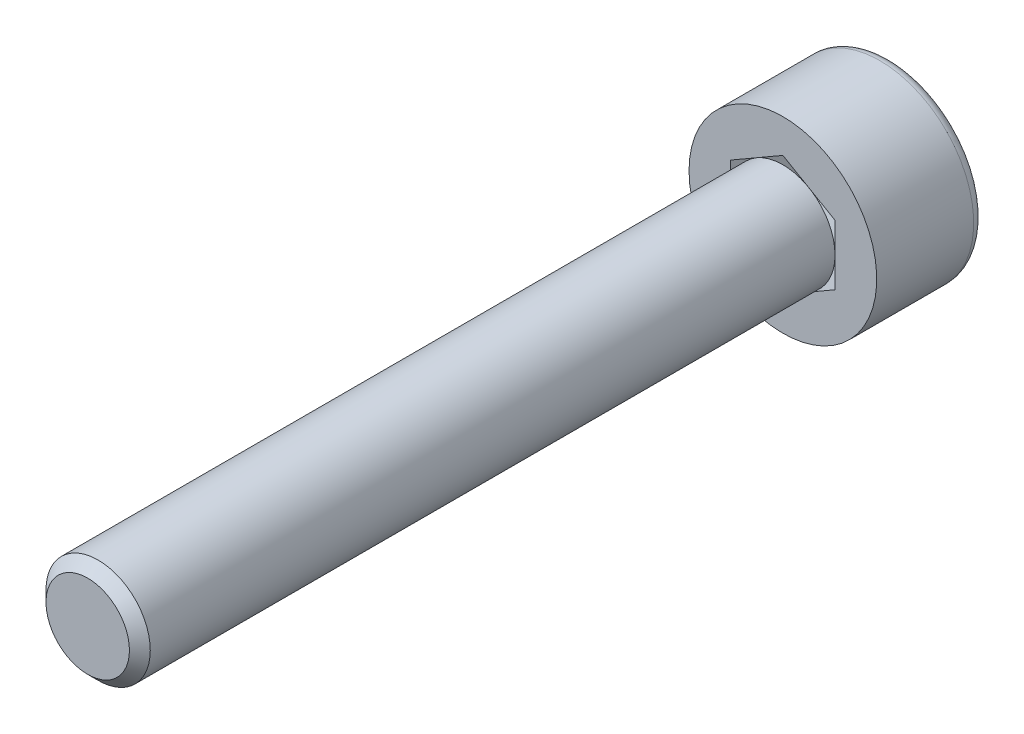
ISO-10303-21;
HEADER;
FILE_DESCRIPTION(('STEP AP214'),'2;1');
FILE_NAME('part.step','',(''),(''),'','','');
FILE_SCHEMA(('AUTOMOTIVE_DESIGN { 1 0 10303 214 1 1 1 1 }'));
ENDSEC;
DATA;
#1=APPLICATION_CONTEXT('core data for automotive mechanical design processes');
#2=APPLICATION_PROTOCOL_DEFINITION('international standard','automotive_design',2000,#1);
#3=PRODUCT_CONTEXT('',#1,'mechanical');
#4=PRODUCT('Part','Part','',(#3));
#5=PRODUCT_RELATED_PRODUCT_CATEGORY('part','',(#4));
#6=PRODUCT_DEFINITION_FORMATION('','',#4);
#7=PRODUCT_DEFINITION_CONTEXT('part definition',#1,'design');
#8=PRODUCT_DEFINITION('design','',#6,#7);
#9=PRODUCT_DEFINITION_SHAPE('','',#8);
#10=(LENGTH_UNIT() NAMED_UNIT(*) SI_UNIT(.MILLI.,.METRE.));
#11=(NAMED_UNIT(*) PLANE_ANGLE_UNIT() SI_UNIT($,.RADIAN.));
#12=(NAMED_UNIT(*) SI_UNIT($,.STERADIAN.) SOLID_ANGLE_UNIT());
#13=UNCERTAINTY_MEASURE_WITH_UNIT(LENGTH_MEASURE(1.E-05),#10,'distance_accuracy_value','');
#14=(GEOMETRIC_REPRESENTATION_CONTEXT(3) GLOBAL_UNCERTAINTY_ASSIGNED_CONTEXT((#13)) GLOBAL_UNIT_ASSIGNED_CONTEXT((#10,
#11,#12)) REPRESENTATION_CONTEXT('',''));
#15=CARTESIAN_POINT('',(0.,0.,0.));
#16=DIRECTION('',(0.,0.,1.));
#17=DIRECTION('',(1.,0.,0.));
#18=AXIS2_PLACEMENT_3D('',#15,#16,#17);
#19=CARTESIAN_POINT('',(0.,0.,20.));
#20=DIRECTION('',(0.,0.,1.));
#21=DIRECTION('',(1.,0.,0.));
#22=AXIS2_PLACEMENT_3D('',#19,#20,#21);
#23=PLANE('',#22);
#24=CARTESIAN_POINT('',(0.,0.,20.));
#25=DIRECTION('',(0.,0.,1.));
#26=DIRECTION('',(1.,0.,0.));
#27=AXIS2_PLACEMENT_3D('',#24,#25,#26);
#28=CIRCLE('',#27,1.2);
#29=CARTESIAN_POINT('',(1.2,0.,20.));
#30=VERTEX_POINT('',#29);
#31=EDGE_CURVE('E45',#30,#30,#28,.T.);
#32=ORIENTED_EDGE('',*,*,#31,.T.);
#33=EDGE_LOOP('',(#32));
#34=FACE_BOUND('',#33,.T.);
#35=ADVANCED_FACE('F38',(#34),#23,.T.);
#36=CARTESIAN_POINT('',(0.,0.,0.));
#37=DIRECTION('',(0.,0.,1.));
#38=DIRECTION('',(1.,0.,0.));
#39=AXIS2_PLACEMENT_3D('',#36,#37,#38);
#40=CYLINDRICAL_SURFACE('',#39,1.5);
#41=CARTESIAN_POINT('',(0.,0.,19.7));
#42=DIRECTION('',(0.,0.,1.));
#43=DIRECTION('',(1.,0.,0.));
#44=AXIS2_PLACEMENT_3D('',#41,#42,#43);
#45=CIRCLE('',#44,1.5);
#46=CARTESIAN_POINT('',(1.5,0.,19.7));
#47=VERTEX_POINT('',#46);
#48=EDGE_CURVE('E11',#47,#47,#45,.F.);
#49=ORIENTED_EDGE('',*,*,#48,.T.);
#50=EDGE_LOOP('',(#49));
#51=FACE_BOUND('',#50,.T.);
#52=CARTESIAN_POINT('',(0.,0.,0.));
#53=DIRECTION('',(0.,0.,1.));
#54=DIRECTION('',(1.,0.,0.));
#55=AXIS2_PLACEMENT_3D('',#52,#53,#54);
#56=CIRCLE('',#55,1.5);
#57=CARTESIAN_POINT('',(1.5,0.,0.));
#58=VERTEX_POINT('',#57);
#59=EDGE_CURVE('E49',#58,#58,#56,.T.);
#60=ORIENTED_EDGE('',*,*,#59,.T.);
#61=EDGE_LOOP('',(#60));
#62=FACE_BOUND('',#61,.T.);
#63=ADVANCED_FACE('F56',(#51,#62),#40,.T.);
#64=CARTESIAN_POINT('',(0.,0.,0.));
#65=DIRECTION('',(0.,0.,-1.));
#66=DIRECTION('',(-1.,0.,0.));
#67=AXIS2_PLACEMENT_3D('',#64,#65,#66);
#68=PLANE('',#67);
#69=ORIENTED_EDGE('',*,*,#59,.F.);
#70=EDGE_LOOP('',(#69));
#71=FACE_BOUND('',#70,.T.);
#72=ADVANCED_FACE('F58',(#71),#68,.T.);
#73=CARTESIAN_POINT('',(0.,0.,20.));
#74=DIRECTION('',(0.,0.,-1.));
#75=DIRECTION('',(-1.,0.,0.));
#76=AXIS2_PLACEMENT_3D('',#73,#74,#75);
#77=CONICAL_SURFACE('',#76,1.2,0.785398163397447);
#78=ORIENTED_EDGE('',*,*,#48,.F.);
#79=EDGE_LOOP('',(#78));
#80=FACE_BOUND('',#79,.T.);
#81=ORIENTED_EDGE('',*,*,#31,.F.);
#82=EDGE_LOOP('',(#81));
#83=FACE_BOUND('',#82,.T.);
#84=ADVANCED_FACE('F40',(#80,#83),#77,.T.);
#85=CLOSED_SHELL('',(#35,#63,#72,#84));
#86=MANIFOLD_SOLID_BREP('B2',#85);
#87=CARTESIAN_POINT('',(0.,0.,-3.1));
#88=DIRECTION('',(0.,0.,1.));
#89=DIRECTION('',(1.,0.,0.));
#90=AXIS2_PLACEMENT_3D('',#87,#88,#89);
#91=PLANE('',#90);
#92=CARTESIAN_POINT('',(0.,0.,-3.1));
#93=DIRECTION('',(0.,0.,-1.));
#94=DIRECTION('',(-1.,0.,0.));
#95=AXIS2_PLACEMENT_3D('',#92,#93,#94);
#96=CIRCLE('',#95,2.39);
#97=CARTESIAN_POINT('',(-2.39,0.,-3.1));
#98=VERTEX_POINT('',#97);
#99=EDGE_CURVE('E207',#98,#98,#96,.T.);
#100=ORIENTED_EDGE('',*,*,#99,.T.);
#101=EDGE_LOOP('',(#100));
#102=FACE_BOUND('',#101,.T.);
#103=DIRECTION('',(-0.86602540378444,0.499999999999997,0.));
#104=VECTOR('',#103,1.);
#105=CARTESIAN_POINT('',(0.,1.73205080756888,-3.1));
#106=LINE('',#105,#104);
#107=CARTESIAN_POINT('',(1.5,0.866025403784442,-3.1));
#108=VERTEX_POINT('',#107);
#109=CARTESIAN_POINT('',(0.,1.73205080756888,-3.1));
#110=VERTEX_POINT('',#109);
#111=EDGE_CURVE('E165',#108,#110,#106,.T.);
#112=ORIENTED_EDGE('',*,*,#111,.T.);
#113=DIRECTION('',(-0.866025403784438,-0.500000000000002,0.));
#114=VECTOR('',#113,1.);
#115=CARTESIAN_POINT('',(0.,1.73205080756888,-3.1));
#116=LINE('',#115,#114);
#117=CARTESIAN_POINT('',(-1.5,0.866025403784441,-3.1));
#118=VERTEX_POINT('',#117);
#119=EDGE_CURVE('E172',#110,#118,#116,.T.);
#120=ORIENTED_EDGE('',*,*,#119,.T.);
#121=DIRECTION('',(0.,-1.,0.));
#122=VECTOR('',#121,1.);
#123=CARTESIAN_POINT('',(-1.5,-0.866025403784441,-3.1));
#124=LINE('',#123,#122);
#125=CARTESIAN_POINT('',(-1.5,-0.866025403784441,-3.1));
#126=VERTEX_POINT('',#125);
#127=EDGE_CURVE('E178',#118,#126,#124,.T.);
#128=ORIENTED_EDGE('',*,*,#127,.T.);
#129=DIRECTION('',(0.866025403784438,-0.500000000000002,0.));
#130=VECTOR('',#129,1.);
#131=CARTESIAN_POINT('',(0.,-1.73205080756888,-3.1));
#132=LINE('',#131,#130);
#133=CARTESIAN_POINT('',(0.,-1.73205080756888,-3.1));
#134=VERTEX_POINT('',#133);
#135=EDGE_CURVE('E187',#126,#134,#132,.T.);
#136=ORIENTED_EDGE('',*,*,#135,.T.);
#137=DIRECTION('',(0.86602540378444,0.499999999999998,0.));
#138=VECTOR('',#137,1.);
#139=CARTESIAN_POINT('',(0.,-1.73205080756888,-3.1));
#140=LINE('',#139,#138);
#141=CARTESIAN_POINT('',(1.5,-0.866025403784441,-3.1));
#142=VERTEX_POINT('',#141);
#143=EDGE_CURVE('E190',#134,#142,#140,.T.);
#144=ORIENTED_EDGE('',*,*,#143,.T.);
#145=DIRECTION('',(0.,1.,0.));
#146=VECTOR('',#145,1.);
#147=CARTESIAN_POINT('',(1.5,-0.866025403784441,-3.1));
#148=LINE('',#147,#146);
#149=EDGE_CURVE('E183',#142,#108,#148,.T.);
#150=ORIENTED_EDGE('',*,*,#149,.T.);
#151=EDGE_LOOP('',(#112,#120,#128,#136,#144,#150));
#152=FACE_BOUND('',#151,.T.);
#153=ADVANCED_FACE('F93',(#102,#152),#91,.F.);
#154=CARTESIAN_POINT('',(0.,0.,0.));
#155=DIRECTION('',(0.,0.,-1.));
#156=DIRECTION('',(-1.,0.,0.));
#157=AXIS2_PLACEMENT_3D('',#154,#155,#156);
#158=PLANE('',#157);
#159=CARTESIAN_POINT('',(0.,0.,0.));
#160=DIRECTION('',(0.,0.,-1.));
#161=DIRECTION('',(-1.,0.,0.));
#162=AXIS2_PLACEMENT_3D('',#159,#160,#161);
#163=CIRCLE('',#162,2.7);
#164=CARTESIAN_POINT('',(-2.7,0.,0.));
#165=VERTEX_POINT('',#164);
#166=EDGE_CURVE('E168',#165,#165,#163,.T.);
#167=ORIENTED_EDGE('',*,*,#166,.F.);
#168=EDGE_LOOP('',(#167));
#169=FACE_BOUND('',#168,.T.);
#170=DIRECTION('',(-0.86602540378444,0.499999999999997,0.));
#171=VECTOR('',#170,1.);
#172=CARTESIAN_POINT('',(0.749999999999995,1.29903810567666,0.));
#173=LINE('',#172,#171);
#174=CARTESIAN_POINT('',(1.5,0.866025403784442,0.));
#175=VERTEX_POINT('',#174);
#176=CARTESIAN_POINT('',(0.749999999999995,1.29903810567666,0.));
#177=VERTEX_POINT('',#176);
#178=EDGE_CURVE('E36',#175,#177,#173,.T.);
#179=ORIENTED_EDGE('',*,*,#178,.F.);
#180=DIRECTION('',(0.,1.,0.));
#181=VECTOR('',#180,1.);
#182=CARTESIAN_POINT('',(1.5,0.,0.));
#183=LINE('',#182,#181);
#184=CARTESIAN_POINT('',(1.5,0.,0.));
#185=VERTEX_POINT('',#184);
#186=EDGE_CURVE('E210',#185,#175,#183,.T.);
#187=ORIENTED_EDGE('',*,*,#186,.F.);
#188=CARTESIAN_POINT('',(1.5,-0.866025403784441,0.));
#189=VERTEX_POINT('',#188);
#190=EDGE_CURVE('E211',#189,#185,#183,.T.);
#191=ORIENTED_EDGE('',*,*,#190,.F.);
#192=DIRECTION('',(0.86602540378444,0.499999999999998,0.));
#193=VECTOR('',#192,1.);
#194=CARTESIAN_POINT('',(0.749999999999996,-1.29903810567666,0.));
#195=LINE('',#194,#193);
#196=CARTESIAN_POINT('',(0.749999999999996,-1.29903810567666,0.));
#197=VERTEX_POINT('',#196);
#198=EDGE_CURVE('E214',#197,#189,#195,.T.);
#199=ORIENTED_EDGE('',*,*,#198,.F.);
#200=CARTESIAN_POINT('',(0.,-1.73205080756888,0.));
#201=VERTEX_POINT('',#200);
#202=EDGE_CURVE('E215',#201,#197,#195,.T.);
#203=ORIENTED_EDGE('',*,*,#202,.F.);
#204=DIRECTION('',(0.866025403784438,-0.500000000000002,0.));
#205=VECTOR('',#204,1.);
#206=CARTESIAN_POINT('',(-0.750000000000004,-1.29903810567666,0.));
#207=LINE('',#206,#205);
#208=CARTESIAN_POINT('',(-0.750000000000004,-1.29903810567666,0.));
#209=VERTEX_POINT('',#208);
#210=EDGE_CURVE('E218',#209,#201,#207,.T.);
#211=ORIENTED_EDGE('',*,*,#210,.F.);
#212=CARTESIAN_POINT('',(-1.5,-0.866025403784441,0.));
#213=VERTEX_POINT('',#212);
#214=EDGE_CURVE('E219',#213,#209,#207,.T.);
#215=ORIENTED_EDGE('',*,*,#214,.F.);
#216=DIRECTION('',(0.,-1.,0.));
#217=VECTOR('',#216,1.);
#218=CARTESIAN_POINT('',(-1.5,0.,0.));
#219=LINE('',#218,#217);
#220=CARTESIAN_POINT('',(-1.5,0.,0.));
#221=VERTEX_POINT('',#220);
#222=EDGE_CURVE('E222',#221,#213,#219,.T.);
#223=ORIENTED_EDGE('',*,*,#222,.F.);
#224=CARTESIAN_POINT('',(-1.5,0.866025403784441,0.));
#225=VERTEX_POINT('',#224);
#226=EDGE_CURVE('E223',#225,#221,#219,.T.);
#227=ORIENTED_EDGE('',*,*,#226,.F.);
#228=DIRECTION('',(-0.866025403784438,-0.500000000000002,0.));
#229=VECTOR('',#228,1.);
#230=CARTESIAN_POINT('',(-0.750000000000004,1.29903810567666,0.));
#231=LINE('',#230,#229);
#232=CARTESIAN_POINT('',(-0.750000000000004,1.29903810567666,0.));
#233=VERTEX_POINT('',#232);
#234=EDGE_CURVE('E111',#233,#225,#231,.T.);
#235=ORIENTED_EDGE('',*,*,#234,.F.);
#236=CARTESIAN_POINT('',(0.,1.73205080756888,0.));
#237=VERTEX_POINT('',#236);
#238=EDGE_CURVE('E225',#237,#233,#231,.T.);
#239=ORIENTED_EDGE('',*,*,#238,.F.);
#240=EDGE_CURVE('E100',#177,#237,#173,.T.);
#241=ORIENTED_EDGE('',*,*,#240,.F.);
#242=EDGE_LOOP('',(#179,#187,#191,#199,#203,#211,#215,#223,#227,#235,#239,#241));
#243=FACE_BOUND('',#242,.T.);
#244=ADVANCED_FACE('F228',(#169,#243),#158,.F.);
#245=CARTESIAN_POINT('',(0.,0.,-2.79));
#246=DIRECTION('',(0.,0.,-1.));
#247=DIRECTION('',(-1.,0.,0.));
#248=AXIS2_PLACEMENT_3D('',#245,#246,#247);
#249=TOROIDAL_SURFACE('',#248,2.39,0.31);
#250=ORIENTED_EDGE('',*,*,#99,.F.);
#251=EDGE_LOOP('',(#250));
#252=FACE_BOUND('',#251,.T.);
#253=CARTESIAN_POINT('',(0.,0.,-2.79));
#254=DIRECTION('',(0.,0.,-1.));
#255=DIRECTION('',(-1.,0.,0.));
#256=AXIS2_PLACEMENT_3D('',#253,#254,#255);
#257=CIRCLE('',#256,2.7);
#258=CARTESIAN_POINT('',(-2.7,0.,-2.79));
#259=VERTEX_POINT('',#258);
#260=EDGE_CURVE('E204',#259,#259,#257,.T.);
#261=ORIENTED_EDGE('',*,*,#260,.T.);
#262=EDGE_LOOP('',(#261));
#263=FACE_BOUND('',#262,.T.);
#264=ADVANCED_FACE('F254',(#252,#263),#249,.T.);
#265=CARTESIAN_POINT('',(0.,0.,0.));
#266=DIRECTION('',(0.,0.,-1.));
#267=DIRECTION('',(-1.,0.,0.));
#268=AXIS2_PLACEMENT_3D('',#265,#266,#267);
#269=CYLINDRICAL_SURFACE('',#268,2.7);
#270=ORIENTED_EDGE('',*,*,#260,.F.);
#271=EDGE_LOOP('',(#270));
#272=FACE_BOUND('',#271,.T.);
#273=ORIENTED_EDGE('',*,*,#166,.T.);
#274=EDGE_LOOP('',(#273));
#275=FACE_BOUND('',#274,.T.);
#276=ADVANCED_FACE('F261',(#272,#275),#269,.T.);
#277=CARTESIAN_POINT('',(0.,1.73205080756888,3.9));
#278=DIRECTION('',(-0.499999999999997,-0.86602540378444,0.));
#279=DIRECTION('',(0.86602540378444,-0.499999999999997,0.));
#280=AXIS2_PLACEMENT_3D('',#277,#278,#279);
#281=PLANE('',#280);
#282=ORIENTED_EDGE('',*,*,#178,.T.);
#283=ORIENTED_EDGE('',*,*,#240,.T.);
#284=DIRECTION('',(0.,0.,-1.));
#285=VECTOR('',#284,1.);
#286=CARTESIAN_POINT('',(0.,1.73205080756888,3.9));
#287=LINE('',#286,#285);
#288=EDGE_CURVE('E160',#237,#110,#287,.T.);
#289=ORIENTED_EDGE('',*,*,#288,.T.);
#290=ORIENTED_EDGE('',*,*,#111,.F.);
#291=DIRECTION('',(0.,0.,-1.));
#292=VECTOR('',#291,1.);
#293=CARTESIAN_POINT('',(1.5,0.866025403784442,3.9));
#294=LINE('',#293,#292);
#295=EDGE_CURVE('E193',#175,#108,#294,.T.);
#296=ORIENTED_EDGE('',*,*,#295,.F.);
#297=EDGE_LOOP('',(#282,#283,#289,#290,#296));
#298=FACE_BOUND('',#297,.T.);
#299=ADVANCED_FACE('F162',(#298),#281,.T.);
#300=CARTESIAN_POINT('',(0.,1.73205080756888,3.9));
#301=DIRECTION('',(0.500000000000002,-0.866025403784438,0.));
#302=DIRECTION('',(0.866025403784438,0.500000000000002,0.));
#303=AXIS2_PLACEMENT_3D('',#300,#301,#302);
#304=PLANE('',#303);
#305=ORIENTED_EDGE('',*,*,#238,.T.);
#306=ORIENTED_EDGE('',*,*,#234,.T.);
#307=DIRECTION('',(0.,0.,-1.));
#308=VECTOR('',#307,1.);
#309=CARTESIAN_POINT('',(-1.5,0.866025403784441,3.9));
#310=LINE('',#309,#308);
#311=EDGE_CURVE('E169',#225,#118,#310,.T.);
#312=ORIENTED_EDGE('',*,*,#311,.T.);
#313=ORIENTED_EDGE('',*,*,#119,.F.);
#314=ORIENTED_EDGE('',*,*,#288,.F.);
#315=EDGE_LOOP('',(#305,#306,#312,#313,#314));
#316=FACE_BOUND('',#315,.T.);
#317=ADVANCED_FACE('F173',(#316),#304,.T.);
#318=CARTESIAN_POINT('',(-1.5,-0.866025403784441,3.9));
#319=DIRECTION('',(1.,0.,0.));
#320=DIRECTION('',(0.,0.,-1.));
#321=AXIS2_PLACEMENT_3D('',#318,#319,#320);
#322=PLANE('',#321);
#323=ORIENTED_EDGE('',*,*,#226,.T.);
#324=ORIENTED_EDGE('',*,*,#222,.T.);
#325=DIRECTION('',(0.,0.,-1.));
#326=VECTOR('',#325,1.);
#327=CARTESIAN_POINT('',(-1.5,-0.866025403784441,3.9));
#328=LINE('',#327,#326);
#329=EDGE_CURVE('E199',#213,#126,#328,.T.);
#330=ORIENTED_EDGE('',*,*,#329,.T.);
#331=ORIENTED_EDGE('',*,*,#127,.F.);
#332=ORIENTED_EDGE('',*,*,#311,.F.);
#333=EDGE_LOOP('',(#323,#324,#330,#331,#332));
#334=FACE_BOUND('',#333,.T.);
#335=ADVANCED_FACE('F227',(#334),#322,.T.);
#336=CARTESIAN_POINT('',(0.,-1.73205080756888,3.9));
#337=DIRECTION('',(0.500000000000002,0.866025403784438,0.));
#338=DIRECTION('',(-0.866025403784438,0.500000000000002,0.));
#339=AXIS2_PLACEMENT_3D('',#336,#337,#338);
#340=PLANE('',#339);
#341=ORIENTED_EDGE('',*,*,#214,.T.);
#342=ORIENTED_EDGE('',*,*,#210,.T.);
#343=DIRECTION('',(0.,0.,-1.));
#344=VECTOR('',#343,1.);
#345=CARTESIAN_POINT('',(0.,-1.73205080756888,3.9));
#346=LINE('',#345,#344);
#347=EDGE_CURVE('E197',#201,#134,#346,.T.);
#348=ORIENTED_EDGE('',*,*,#347,.T.);
#349=ORIENTED_EDGE('',*,*,#135,.F.);
#350=ORIENTED_EDGE('',*,*,#329,.F.);
#351=EDGE_LOOP('',(#341,#342,#348,#349,#350));
#352=FACE_BOUND('',#351,.T.);
#353=ADVANCED_FACE('F233',(#352),#340,.T.);
#354=CARTESIAN_POINT('',(0.,-1.73205080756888,3.9));
#355=DIRECTION('',(-0.499999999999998,0.86602540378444,0.));
#356=DIRECTION('',(-0.86602540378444,-0.499999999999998,0.));
#357=AXIS2_PLACEMENT_3D('',#354,#355,#356);
#358=PLANE('',#357);
#359=ORIENTED_EDGE('',*,*,#202,.T.);
#360=ORIENTED_EDGE('',*,*,#198,.T.);
#361=DIRECTION('',(0.,0.,-1.));
#362=VECTOR('',#361,1.);
#363=CARTESIAN_POINT('',(1.5,-0.866025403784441,3.9));
#364=LINE('',#363,#362);
#365=EDGE_CURVE('E195',#189,#142,#364,.T.);
#366=ORIENTED_EDGE('',*,*,#365,.T.);
#367=ORIENTED_EDGE('',*,*,#143,.F.);
#368=ORIENTED_EDGE('',*,*,#347,.F.);
#369=EDGE_LOOP('',(#359,#360,#366,#367,#368));
#370=FACE_BOUND('',#369,.T.);
#371=ADVANCED_FACE('F237',(#370),#358,.T.);
#372=CARTESIAN_POINT('',(1.5,-0.866025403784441,3.9));
#373=DIRECTION('',(-1.,0.,0.));
#374=DIRECTION('',(0.,-1.,0.));
#375=AXIS2_PLACEMENT_3D('',#372,#373,#374);
#376=PLANE('',#375);
#377=ORIENTED_EDGE('',*,*,#190,.T.);
#378=ORIENTED_EDGE('',*,*,#186,.T.);
#379=ORIENTED_EDGE('',*,*,#295,.T.);
#380=ORIENTED_EDGE('',*,*,#149,.F.);
#381=ORIENTED_EDGE('',*,*,#365,.F.);
#382=EDGE_LOOP('',(#377,#378,#379,#380,#381));
#383=FACE_BOUND('',#382,.T.);
#384=ADVANCED_FACE('F242',(#383),#376,.T.);
#385=CLOSED_SHELL('',(#153,#244,#264,#276,#299,#317,#335,#353,#371,#384));
#386=MANIFOLD_SOLID_BREP('B6',#385);
#387=ADVANCED_BREP_SHAPE_REPRESENTATION('',(#18,#86,#386),#14);
#388=SHAPE_DEFINITION_REPRESENTATION(#9,#387);
ENDSEC;
END-ISO-10303-21;
